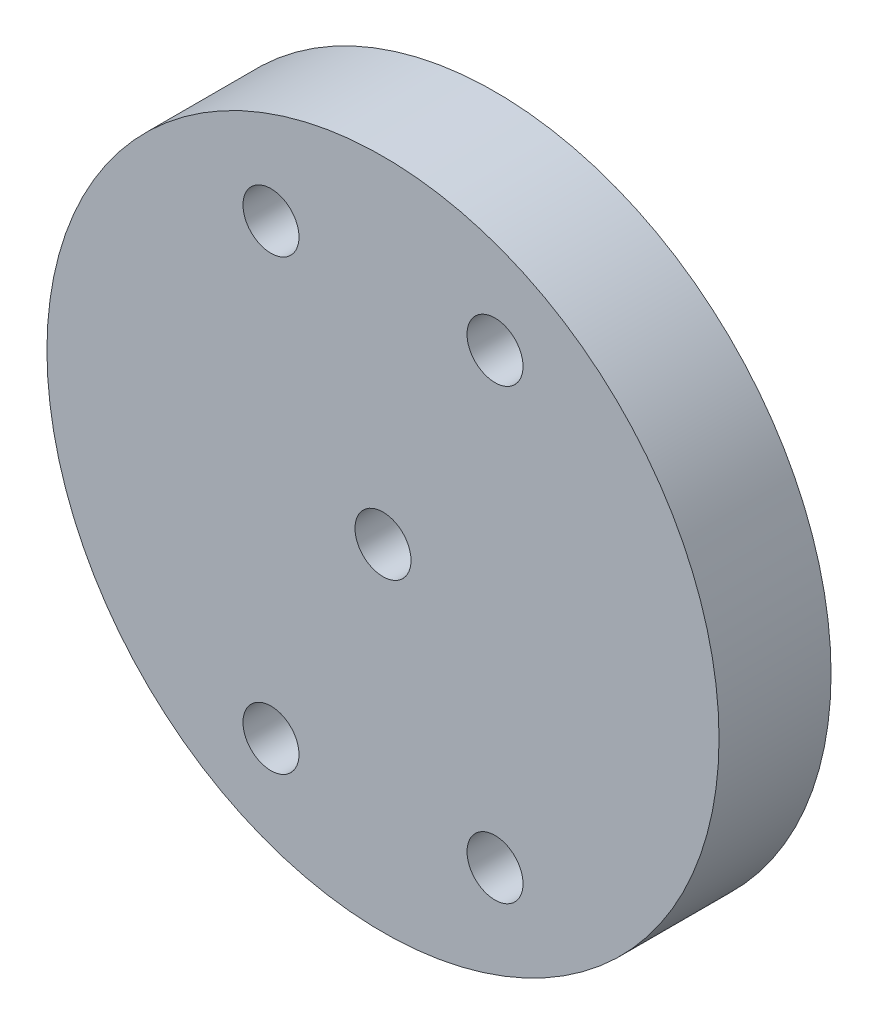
ISO-10303-21;
HEADER;
FILE_DESCRIPTION(('STEP AP214'),'2;1');
FILE_NAME('part.step','',(''),(''),'','','');
FILE_SCHEMA(('AUTOMOTIVE_DESIGN { 1 0 10303 214 1 1 1 1 }'));
ENDSEC;
DATA;
#1=APPLICATION_CONTEXT('core data for automotive mechanical design processes');
#2=APPLICATION_PROTOCOL_DEFINITION('international standard','automotive_design',2000,#1);
#3=PRODUCT_CONTEXT('',#1,'mechanical');
#4=PRODUCT('Part','Part','',(#3));
#5=PRODUCT_RELATED_PRODUCT_CATEGORY('part','',(#4));
#6=PRODUCT_DEFINITION_FORMATION('','',#4);
#7=PRODUCT_DEFINITION_CONTEXT('part definition',#1,'design');
#8=PRODUCT_DEFINITION('design','',#6,#7);
#9=PRODUCT_DEFINITION_SHAPE('','',#8);
#10=(LENGTH_UNIT() NAMED_UNIT(*) SI_UNIT(.MILLI.,.METRE.));
#11=(NAMED_UNIT(*) PLANE_ANGLE_UNIT() SI_UNIT($,.RADIAN.));
#12=(NAMED_UNIT(*) SI_UNIT($,.STERADIAN.) SOLID_ANGLE_UNIT());
#13=UNCERTAINTY_MEASURE_WITH_UNIT(LENGTH_MEASURE(1.E-05),#10,'distance_accuracy_value','');
#14=(GEOMETRIC_REPRESENTATION_CONTEXT(3) GLOBAL_UNCERTAINTY_ASSIGNED_CONTEXT((#13)) GLOBAL_UNIT_ASSIGNED_CONTEXT((#10,
#11,#12)) REPRESENTATION_CONTEXT('',''));
#15=CARTESIAN_POINT('',(0.,0.,0.));
#16=DIRECTION('',(0.,0.,1.));
#17=DIRECTION('',(1.,0.,0.));
#18=AXIS2_PLACEMENT_3D('',#15,#16,#17);
#19=CARTESIAN_POINT('',(0.,0.,12.7));
#20=DIRECTION('',(0.,0.,-1.));
#21=DIRECTION('',(-1.,0.,0.));
#22=AXIS2_PLACEMENT_3D('',#19,#20,#21);
#23=CYLINDRICAL_SURFACE('',#22,38.1);
#24=CARTESIAN_POINT('',(0.,0.,12.7));
#25=DIRECTION('',(0.,0.,1.));
#26=DIRECTION('',(1.,0.,0.));
#27=AXIS2_PLACEMENT_3D('',#24,#25,#26);
#28=CIRCLE('',#27,38.1);
#29=CARTESIAN_POINT('',(38.1,0.,12.7));
#30=VERTEX_POINT('',#29);
#31=EDGE_CURVE('E10',#30,#30,#28,.T.);
#32=ORIENTED_EDGE('',*,*,#31,.F.);
#33=EDGE_LOOP('',(#32));
#34=FACE_BOUND('',#33,.T.);
#35=CARTESIAN_POINT('',(0.,0.,0.));
#36=DIRECTION('',(0.,0.,1.));
#37=DIRECTION('',(1.,0.,0.));
#38=AXIS2_PLACEMENT_3D('',#35,#36,#37);
#39=CIRCLE('',#38,38.1);
#40=CARTESIAN_POINT('',(38.1,0.,0.));
#41=VERTEX_POINT('',#40);
#42=EDGE_CURVE('E33',#41,#41,#39,.T.);
#43=ORIENTED_EDGE('',*,*,#42,.T.);
#44=EDGE_LOOP('',(#43));
#45=FACE_BOUND('',#44,.T.);
#46=ADVANCED_FACE('F30',(#34,#45),#23,.T.);
#47=CARTESIAN_POINT('',(0.,0.,12.7));
#48=DIRECTION('',(0.,0.,1.));
#49=DIRECTION('',(1.,0.,0.));
#50=AXIS2_PLACEMENT_3D('',#47,#48,#49);
#51=PLANE('',#50);
#52=CARTESIAN_POINT('',(12.7,25.4,12.7));
#53=DIRECTION('',(0.,0.,1.));
#54=DIRECTION('',(1.,0.,0.));
#55=AXIS2_PLACEMENT_3D('',#52,#53,#54);
#56=CIRCLE('',#55,3.17499999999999);
#57=CARTESIAN_POINT('',(15.875,25.4,12.7));
#58=VERTEX_POINT('',#57);
#59=EDGE_CURVE('E68',#58,#58,#56,.T.);
#60=ORIENTED_EDGE('',*,*,#59,.F.);
#61=EDGE_LOOP('',(#60));
#62=FACE_BOUND('',#61,.T.);
#63=CARTESIAN_POINT('',(-12.7,25.4,12.7));
#64=DIRECTION('',(0.,0.,1.));
#65=DIRECTION('',(1.,0.,0.));
#66=AXIS2_PLACEMENT_3D('',#63,#64,#65);
#67=CIRCLE('',#66,3.17499999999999);
#68=CARTESIAN_POINT('',(-9.52500000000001,25.4,12.7));
#69=VERTEX_POINT('',#68);
#70=EDGE_CURVE('E62',#69,#69,#67,.T.);
#71=ORIENTED_EDGE('',*,*,#70,.F.);
#72=EDGE_LOOP('',(#71));
#73=FACE_BOUND('',#72,.T.);
#74=CARTESIAN_POINT('',(-12.7,-25.4,12.7));
#75=DIRECTION('',(0.,0.,1.));
#76=DIRECTION('',(1.,0.,0.));
#77=AXIS2_PLACEMENT_3D('',#74,#75,#76);
#78=CIRCLE('',#77,3.17499999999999);
#79=CARTESIAN_POINT('',(-9.52500000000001,-25.4,12.7));
#80=VERTEX_POINT('',#79);
#81=EDGE_CURVE('E56',#80,#80,#78,.T.);
#82=ORIENTED_EDGE('',*,*,#81,.F.);
#83=EDGE_LOOP('',(#82));
#84=FACE_BOUND('',#83,.T.);
#85=CARTESIAN_POINT('',(12.7,-25.4,12.7));
#86=DIRECTION('',(0.,0.,1.));
#87=DIRECTION('',(1.,0.,0.));
#88=AXIS2_PLACEMENT_3D('',#85,#86,#87);
#89=CIRCLE('',#88,3.17499999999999);
#90=CARTESIAN_POINT('',(15.875,-25.4,12.7));
#91=VERTEX_POINT('',#90);
#92=EDGE_CURVE('E50',#91,#91,#89,.T.);
#93=ORIENTED_EDGE('',*,*,#92,.F.);
#94=EDGE_LOOP('',(#93));
#95=FACE_BOUND('',#94,.T.);
#96=CARTESIAN_POINT('',(0.,0.,12.7));
#97=DIRECTION('',(0.,0.,1.));
#98=DIRECTION('',(1.,0.,0.));
#99=AXIS2_PLACEMENT_3D('',#96,#97,#98);
#100=CIRCLE('',#99,3.17499999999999);
#101=CARTESIAN_POINT('',(3.17499999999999,0.,12.7));
#102=VERTEX_POINT('',#101);
#103=EDGE_CURVE('E44',#102,#102,#100,.T.);
#104=ORIENTED_EDGE('',*,*,#103,.F.);
#105=EDGE_LOOP('',(#104));
#106=FACE_BOUND('',#105,.T.);
#107=ORIENTED_EDGE('',*,*,#31,.T.);
#108=EDGE_LOOP('',(#107));
#109=FACE_BOUND('',#108,.T.);
#110=ADVANCED_FACE('F74',(#62,#73,#84,#95,#106,#109),#51,.T.);
#111=CARTESIAN_POINT('',(0.,0.,0.));
#112=DIRECTION('',(0.,0.,1.));
#113=DIRECTION('',(1.,0.,0.));
#114=AXIS2_PLACEMENT_3D('',#111,#112,#113);
#115=PLANE('',#114);
#116=CARTESIAN_POINT('',(12.7,25.4,0.));
#117=DIRECTION('',(0.,0.,1.));
#118=DIRECTION('',(1.,0.,0.));
#119=AXIS2_PLACEMENT_3D('',#116,#117,#118);
#120=CIRCLE('',#119,3.175);
#121=CARTESIAN_POINT('',(15.875,25.4,0.));
#122=VERTEX_POINT('',#121);
#123=EDGE_CURVE('E65',#122,#122,#120,.T.);
#124=ORIENTED_EDGE('',*,*,#123,.T.);
#125=EDGE_LOOP('',(#124));
#126=FACE_BOUND('',#125,.T.);
#127=CARTESIAN_POINT('',(-12.7,25.4,0.));
#128=DIRECTION('',(0.,0.,1.));
#129=DIRECTION('',(1.,0.,0.));
#130=AXIS2_PLACEMENT_3D('',#127,#128,#129);
#131=CIRCLE('',#130,3.175);
#132=CARTESIAN_POINT('',(-9.525,25.4,0.));
#133=VERTEX_POINT('',#132);
#134=EDGE_CURVE('E59',#133,#133,#131,.T.);
#135=ORIENTED_EDGE('',*,*,#134,.T.);
#136=EDGE_LOOP('',(#135));
#137=FACE_BOUND('',#136,.T.);
#138=CARTESIAN_POINT('',(-12.7,-25.4,0.));
#139=DIRECTION('',(0.,0.,1.));
#140=DIRECTION('',(1.,0.,0.));
#141=AXIS2_PLACEMENT_3D('',#138,#139,#140);
#142=CIRCLE('',#141,3.175);
#143=CARTESIAN_POINT('',(-9.525,-25.4,0.));
#144=VERTEX_POINT('',#143);
#145=EDGE_CURVE('E53',#144,#144,#142,.T.);
#146=ORIENTED_EDGE('',*,*,#145,.T.);
#147=EDGE_LOOP('',(#146));
#148=FACE_BOUND('',#147,.T.);
#149=CARTESIAN_POINT('',(12.7,-25.4,0.));
#150=DIRECTION('',(0.,0.,1.));
#151=DIRECTION('',(1.,0.,0.));
#152=AXIS2_PLACEMENT_3D('',#149,#150,#151);
#153=CIRCLE('',#152,3.175);
#154=CARTESIAN_POINT('',(15.875,-25.4,0.));
#155=VERTEX_POINT('',#154);
#156=EDGE_CURVE('E47',#155,#155,#153,.T.);
#157=ORIENTED_EDGE('',*,*,#156,.T.);
#158=EDGE_LOOP('',(#157));
#159=FACE_BOUND('',#158,.T.);
#160=CARTESIAN_POINT('',(0.,0.,0.));
#161=DIRECTION('',(0.,0.,1.));
#162=DIRECTION('',(1.,0.,0.));
#163=AXIS2_PLACEMENT_3D('',#160,#161,#162);
#164=CIRCLE('',#163,3.175);
#165=CARTESIAN_POINT('',(3.175,0.,0.));
#166=VERTEX_POINT('',#165);
#167=EDGE_CURVE('E40',#166,#166,#164,.T.);
#168=ORIENTED_EDGE('',*,*,#167,.T.);
#169=EDGE_LOOP('',(#168));
#170=FACE_BOUND('',#169,.T.);
#171=ORIENTED_EDGE('',*,*,#42,.F.);
#172=EDGE_LOOP('',(#171));
#173=FACE_BOUND('',#172,.T.);
#174=ADVANCED_FACE('F77',(#126,#137,#148,#159,#170,#173),#115,.F.);
#175=CARTESIAN_POINT('',(0.,0.,12.7));
#176=DIRECTION('',(0.,0.,1.));
#177=DIRECTION('',(1.,0.,0.));
#178=AXIS2_PLACEMENT_3D('',#175,#176,#177);
#179=CYLINDRICAL_SURFACE('',#178,3.17499999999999);
#180=ORIENTED_EDGE('',*,*,#167,.F.);
#181=EDGE_LOOP('',(#180));
#182=FACE_BOUND('',#181,.T.);
#183=ORIENTED_EDGE('',*,*,#103,.T.);
#184=EDGE_LOOP('',(#183));
#185=FACE_BOUND('',#184,.T.);
#186=ADVANCED_FACE('F87',(#182,#185),#179,.F.);
#187=CARTESIAN_POINT('',(12.7,-25.4,12.7));
#188=DIRECTION('',(0.,0.,1.));
#189=DIRECTION('',(1.,0.,0.));
#190=AXIS2_PLACEMENT_3D('',#187,#188,#189);
#191=CYLINDRICAL_SURFACE('',#190,3.17499999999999);
#192=ORIENTED_EDGE('',*,*,#156,.F.);
#193=EDGE_LOOP('',(#192));
#194=FACE_BOUND('',#193,.T.);
#195=ORIENTED_EDGE('',*,*,#92,.T.);
#196=EDGE_LOOP('',(#195));
#197=FACE_BOUND('',#196,.T.);
#198=ADVANCED_FACE('F89',(#194,#197),#191,.F.);
#199=CARTESIAN_POINT('',(-12.7,-25.4,12.7));
#200=DIRECTION('',(0.,0.,1.));
#201=DIRECTION('',(1.,0.,0.));
#202=AXIS2_PLACEMENT_3D('',#199,#200,#201);
#203=CYLINDRICAL_SURFACE('',#202,3.17499999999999);
#204=ORIENTED_EDGE('',*,*,#145,.F.);
#205=EDGE_LOOP('',(#204));
#206=FACE_BOUND('',#205,.T.);
#207=ORIENTED_EDGE('',*,*,#81,.T.);
#208=EDGE_LOOP('',(#207));
#209=FACE_BOUND('',#208,.T.);
#210=ADVANCED_FACE('F96',(#206,#209),#203,.F.);
#211=CARTESIAN_POINT('',(-12.7,25.4,12.7));
#212=DIRECTION('',(0.,0.,1.));
#213=DIRECTION('',(1.,0.,0.));
#214=AXIS2_PLACEMENT_3D('',#211,#212,#213);
#215=CYLINDRICAL_SURFACE('',#214,3.17499999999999);
#216=ORIENTED_EDGE('',*,*,#134,.F.);
#217=EDGE_LOOP('',(#216));
#218=FACE_BOUND('',#217,.T.);
#219=ORIENTED_EDGE('',*,*,#70,.T.);
#220=EDGE_LOOP('',(#219));
#221=FACE_BOUND('',#220,.T.);
#222=ADVANCED_FACE('F135',(#218,#221),#215,.F.);
#223=CARTESIAN_POINT('',(12.7,25.4,12.7));
#224=DIRECTION('',(0.,0.,1.));
#225=DIRECTION('',(1.,0.,0.));
#226=AXIS2_PLACEMENT_3D('',#223,#224,#225);
#227=CYLINDRICAL_SURFACE('',#226,3.17499999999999);
#228=ORIENTED_EDGE('',*,*,#123,.F.);
#229=EDGE_LOOP('',(#228));
#230=FACE_BOUND('',#229,.T.);
#231=ORIENTED_EDGE('',*,*,#59,.T.);
#232=EDGE_LOOP('',(#231));
#233=FACE_BOUND('',#232,.T.);
#234=ADVANCED_FACE('F72',(#230,#233),#227,.F.);
#235=CLOSED_SHELL('',(#46,#110,#174,#186,#198,#210,#222,#234));
#236=MANIFOLD_SOLID_BREP('B2',#235);
#237=ADVANCED_BREP_SHAPE_REPRESENTATION('',(#18,#236),#14);
#238=SHAPE_DEFINITION_REPRESENTATION(#9,#237);
ENDSEC;
END-ISO-10303-21;
